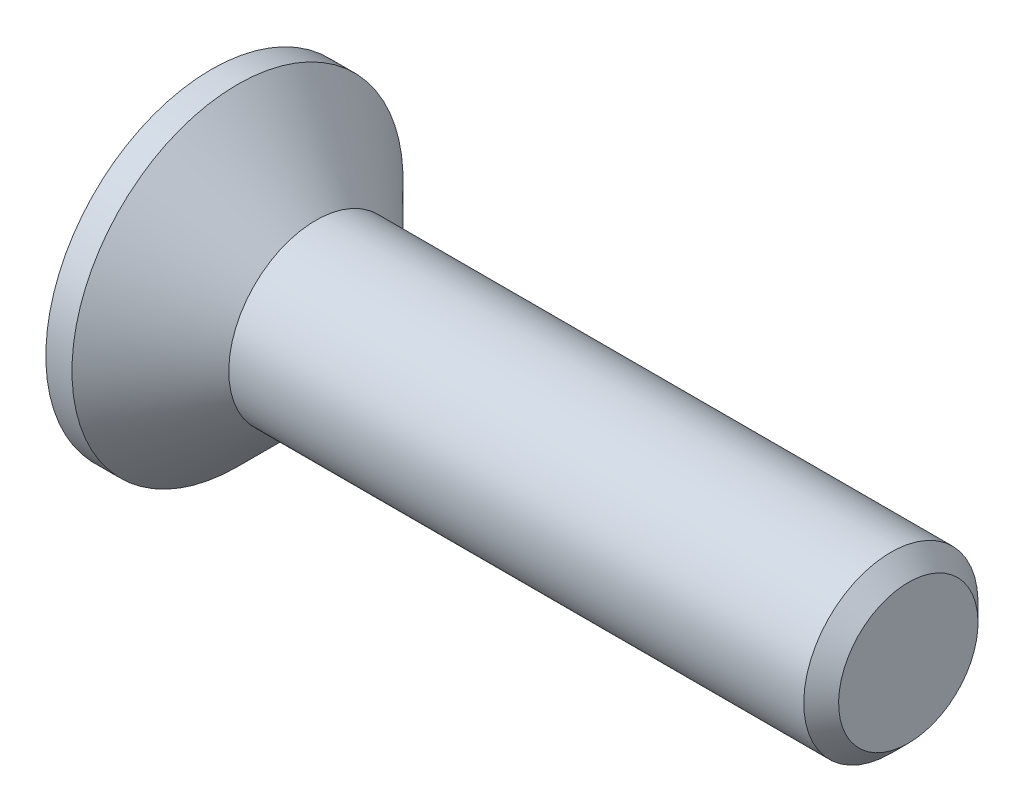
from build123d import *

# Parameters (mm, degrees)
CHAMFER1_SIZE      = 0.2
CUT_EXTRUDE1_DEPTH = 0.95


with BuildPart() as part:
    # Sketch1 → Revolve1 (revolve)
    with BuildSketch(Plane.XY, mode=Mode.PRIVATE) as revolve1_sk:
        Polygon((-1.2, 1.9), (-1.2, 0), (6.8, 0), (6.8, 1), (0, 1), (-0.9, 1.9), align=None)
    revolve(revolve1_sk.sketch.rotate(Axis((-1.2, 0, 0), (1, 0, 0)), 180), axis=Axis((-1.2, 0, 0), (1, 0, 0)))

    # Chamfer1
    chamfer1_edges = [part.edges().sort_by_distance(p)[0] for p in [
        (6.8, 1, 0),
    ]]
    chamfer(chamfer1_edges, length=CHAMFER1_SIZE)

    # Sketch2 → Cut-Extrude1 (cut)
    with BuildSketch(Plane.ZY.offset(1.2)):
        Polygon((-0.3, 1.175), (0.3, 1.175), (0.3, 0.3), (1.175, 0.3), (1.175, -0.3), (0.3, -0.3), (0.3, -1.175), (-0.3, -1.175), (-0.3, -0.3), (-1.175, -0.3), (-1.175, 0.3), (-0.3, 0.3), align=None)
    extrude(amount=-CUT_EXTRUDE1_DEPTH, mode=Mode.SUBTRACT)


solid = part.part
